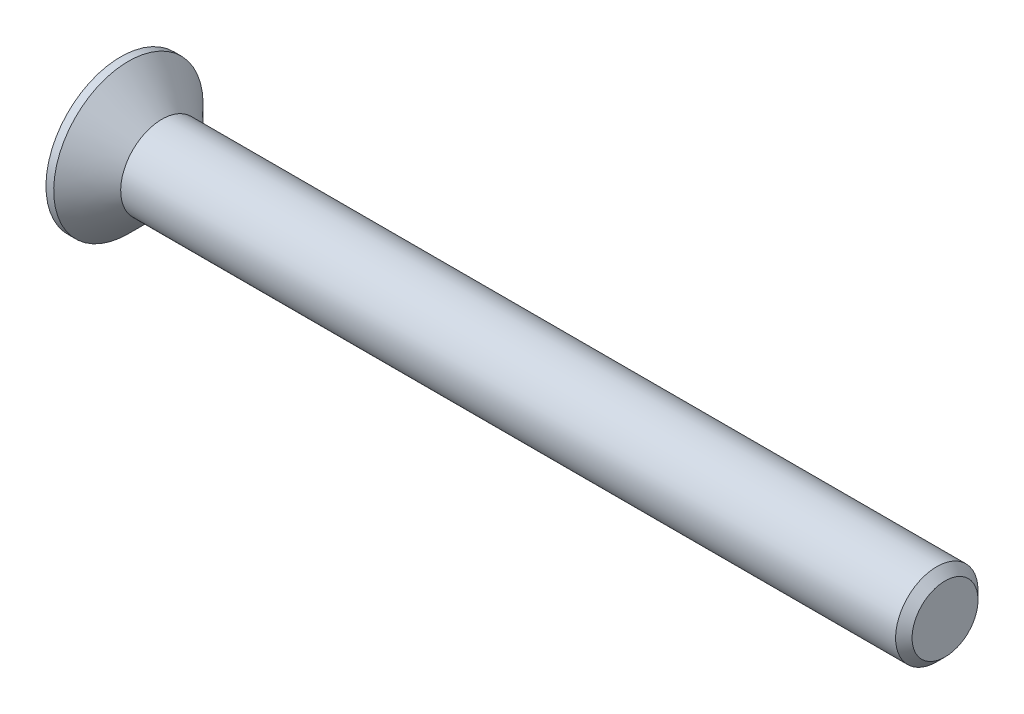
ISO-10303-21;
HEADER;
FILE_DESCRIPTION(('STEP AP214'),'2;1');
FILE_NAME('part.step','',(''),(''),'','','');
FILE_SCHEMA(('AUTOMOTIVE_DESIGN { 1 0 10303 214 1 1 1 1 }'));
ENDSEC;
DATA;
#1=APPLICATION_CONTEXT('core data for automotive mechanical design processes');
#2=APPLICATION_PROTOCOL_DEFINITION('international standard','automotive_design',2000,#1);
#3=PRODUCT_CONTEXT('',#1,'mechanical');
#4=PRODUCT('Part','Part','',(#3));
#5=PRODUCT_RELATED_PRODUCT_CATEGORY('part','',(#4));
#6=PRODUCT_DEFINITION_FORMATION('','',#4);
#7=PRODUCT_DEFINITION_CONTEXT('part definition',#1,'design');
#8=PRODUCT_DEFINITION('design','',#6,#7);
#9=PRODUCT_DEFINITION_SHAPE('','',#8);
#10=(LENGTH_UNIT() NAMED_UNIT(*) SI_UNIT(.MILLI.,.METRE.));
#11=(NAMED_UNIT(*) PLANE_ANGLE_UNIT() SI_UNIT($,.RADIAN.));
#12=(NAMED_UNIT(*) SI_UNIT($,.STERADIAN.) SOLID_ANGLE_UNIT());
#13=UNCERTAINTY_MEASURE_WITH_UNIT(LENGTH_MEASURE(1.E-05),#10,'distance_accuracy_value','');
#14=(GEOMETRIC_REPRESENTATION_CONTEXT(3) GLOBAL_UNCERTAINTY_ASSIGNED_CONTEXT((#13)) GLOBAL_UNIT_ASSIGNED_CONTEXT((#10,
#11,#12)) REPRESENTATION_CONTEXT('',''));
#15=CARTESIAN_POINT('',(0.,0.,0.));
#16=DIRECTION('',(0.,0.,1.));
#17=DIRECTION('',(1.,0.,0.));
#18=AXIS2_PLACEMENT_3D('',#15,#16,#17);
#19=CARTESIAN_POINT('',(0.,0.,0.));
#20=DIRECTION('',(-1.,0.,0.));
#21=DIRECTION('',(0.,-1.,0.));
#22=AXIS2_PLACEMENT_3D('',#19,#20,#21);
#23=CONICAL_SURFACE('',#22,4.,0.78539816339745);
#24=CARTESIAN_POINT('',(-3.24999999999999,0.,0.));
#25=DIRECTION('',(-1.,0.,0.));
#26=DIRECTION('',(0.,-1.,0.));
#27=AXIS2_PLACEMENT_3D('',#24,#25,#26);
#28=CIRCLE('',#27,7.25);
#29=CARTESIAN_POINT('',(-3.24999999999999,-7.25,0.));
#30=VERTEX_POINT('',#29);
#31=EDGE_CURVE('E188',#30,#30,#28,.T.);
#32=ORIENTED_EDGE('',*,*,#31,.F.);
#33=EDGE_LOOP('',(#32));
#34=FACE_BOUND('',#33,.T.);
#35=CARTESIAN_POINT('',(0.,0.,0.));
#36=DIRECTION('',(-1.,0.,0.));
#37=DIRECTION('',(0.,-1.,0.));
#38=AXIS2_PLACEMENT_3D('',#35,#36,#37);
#39=CIRCLE('',#38,4.);
#40=CARTESIAN_POINT('',(0.,-4.,0.));
#41=VERTEX_POINT('',#40);
#42=EDGE_CURVE('E211',#41,#41,#39,.T.);
#43=ORIENTED_EDGE('',*,*,#42,.T.);
#44=EDGE_LOOP('',(#43));
#45=FACE_BOUND('',#44,.T.);
#46=ADVANCED_FACE('F32',(#34,#45),#23,.T.);
#47=CARTESIAN_POINT('',(-4.,0.,0.));
#48=DIRECTION('',(-1.,0.,0.));
#49=DIRECTION('',(0.,-1.,0.));
#50=AXIS2_PLACEMENT_3D('',#47,#48,#49);
#51=CYLINDRICAL_SURFACE('',#50,4.);
#52=CARTESIAN_POINT('',(75.2,0.,0.));
#53=DIRECTION('',(-1.,0.,0.));
#54=DIRECTION('',(0.,-1.,0.));
#55=AXIS2_PLACEMENT_3D('',#52,#53,#54);
#56=CIRCLE('',#55,4.);
#57=CARTESIAN_POINT('',(75.2,-4.,0.));
#58=VERTEX_POINT('',#57);
#59=EDGE_CURVE('E40',#58,#58,#56,.T.);
#60=ORIENTED_EDGE('',*,*,#59,.T.);
#61=EDGE_LOOP('',(#60));
#62=FACE_BOUND('',#61,.T.);
#63=ORIENTED_EDGE('',*,*,#42,.F.);
#64=EDGE_LOOP('',(#63));
#65=FACE_BOUND('',#64,.T.);
#66=ADVANCED_FACE('F216',(#62,#65),#51,.T.);
#67=CARTESIAN_POINT('',(76.,0.,0.));
#68=DIRECTION('',(-1.,0.,0.));
#69=DIRECTION('',(0.,-1.,0.));
#70=AXIS2_PLACEMENT_3D('',#67,#68,#69);
#71=PLANE('',#70);
#72=CARTESIAN_POINT('',(76.,0.,0.));
#73=DIRECTION('',(-1.,0.,0.));
#74=DIRECTION('',(0.,-1.,0.));
#75=AXIS2_PLACEMENT_3D('',#72,#73,#74);
#76=CIRCLE('',#75,3.2);
#77=CARTESIAN_POINT('',(76.,-3.2,0.));
#78=VERTEX_POINT('',#77);
#79=EDGE_CURVE('E11',#78,#78,#76,.F.);
#80=ORIENTED_EDGE('',*,*,#79,.T.);
#81=EDGE_LOOP('',(#80));
#82=FACE_BOUND('',#81,.T.);
#83=ADVANCED_FACE('F238',(#82),#71,.F.);
#84=CARTESIAN_POINT('',(-4.,7.25,0.));
#85=DIRECTION('',(1.,0.,0.));
#86=DIRECTION('',(0.,1.,0.));
#87=AXIS2_PLACEMENT_3D('',#84,#85,#86);
#88=PLANE('',#87);
#89=DIRECTION('',(0.,0.,-1.));
#90=VECTOR('',#89,1.);
#91=CARTESIAN_POINT('',(-4.,1.09,-4.35));
#92=LINE('',#91,#90);
#93=CARTESIAN_POINT('',(-4.,1.09,-1.09));
#94=VERTEX_POINT('',#93);
#95=CARTESIAN_POINT('',(-4.,1.09,-4.35));
#96=VERTEX_POINT('',#95);
#97=EDGE_CURVE('E157',#94,#96,#92,.T.);
#98=ORIENTED_EDGE('',*,*,#97,.F.);
#99=DIRECTION('',(0.,-1.,0.));
#100=VECTOR('',#99,1.);
#101=CARTESIAN_POINT('',(-4.,1.09,-1.09));
#102=LINE('',#101,#100);
#103=CARTESIAN_POINT('',(-4.,4.35,-1.09));
#104=VERTEX_POINT('',#103);
#105=EDGE_CURVE('E47',#104,#94,#102,.T.);
#106=ORIENTED_EDGE('',*,*,#105,.F.);
#107=DIRECTION('',(0.,0.,-1.));
#108=VECTOR('',#107,1.);
#109=CARTESIAN_POINT('',(-4.,4.35,-1.09));
#110=LINE('',#109,#108);
#111=CARTESIAN_POINT('',(-4.,4.35,1.09));
#112=VERTEX_POINT('',#111);
#113=EDGE_CURVE('E184',#112,#104,#110,.T.);
#114=ORIENTED_EDGE('',*,*,#113,.F.);
#115=DIRECTION('',(0.,1.,0.));
#116=VECTOR('',#115,1.);
#117=CARTESIAN_POINT('',(-4.,4.35,1.09));
#118=LINE('',#117,#116);
#119=CARTESIAN_POINT('',(-4.,1.09,1.09));
#120=VERTEX_POINT('',#119);
#121=EDGE_CURVE('E182',#120,#112,#118,.T.);
#122=ORIENTED_EDGE('',*,*,#121,.F.);
#123=DIRECTION('',(0.,0.,-1.));
#124=VECTOR('',#123,1.);
#125=CARTESIAN_POINT('',(-4.,1.09,1.09));
#126=LINE('',#125,#124);
#127=CARTESIAN_POINT('',(-4.,1.09,4.35));
#128=VERTEX_POINT('',#127);
#129=EDGE_CURVE('E131',#128,#120,#126,.T.);
#130=ORIENTED_EDGE('',*,*,#129,.F.);
#131=DIRECTION('',(0.,1.,0.));
#132=VECTOR('',#131,1.);
#133=CARTESIAN_POINT('',(-4.,1.09,4.35));
#134=LINE('',#133,#132);
#135=CARTESIAN_POINT('',(-4.,-1.09,4.35));
#136=VERTEX_POINT('',#135);
#137=EDGE_CURVE('E178',#136,#128,#134,.T.);
#138=ORIENTED_EDGE('',*,*,#137,.F.);
#139=DIRECTION('',(0.,0.,1.));
#140=VECTOR('',#139,1.);
#141=CARTESIAN_POINT('',(-4.,-1.09,4.35));
#142=LINE('',#141,#140);
#143=CARTESIAN_POINT('',(-4.,-1.09,1.09));
#144=VERTEX_POINT('',#143);
#145=EDGE_CURVE('E175',#144,#136,#142,.T.);
#146=ORIENTED_EDGE('',*,*,#145,.F.);
#147=DIRECTION('',(0.,1.,0.));
#148=VECTOR('',#147,1.);
#149=CARTESIAN_POINT('',(-4.,-1.09,1.09));
#150=LINE('',#149,#148);
#151=CARTESIAN_POINT('',(-4.,-4.35,1.09));
#152=VERTEX_POINT('',#151);
#153=EDGE_CURVE('E172',#152,#144,#150,.T.);
#154=ORIENTED_EDGE('',*,*,#153,.F.);
#155=DIRECTION('',(0.,0.,1.));
#156=VECTOR('',#155,1.);
#157=CARTESIAN_POINT('',(-4.,-4.35,1.09));
#158=LINE('',#157,#156);
#159=CARTESIAN_POINT('',(-4.,-4.35,-1.09));
#160=VERTEX_POINT('',#159);
#161=EDGE_CURVE('E169',#160,#152,#158,.T.);
#162=ORIENTED_EDGE('',*,*,#161,.F.);
#163=DIRECTION('',(0.,-1.,0.));
#164=VECTOR('',#163,1.);
#165=CARTESIAN_POINT('',(-4.,-4.35,-1.09));
#166=LINE('',#165,#164);
#167=CARTESIAN_POINT('',(-4.,-1.09,-1.09));
#168=VERTEX_POINT('',#167);
#169=EDGE_CURVE('E166',#168,#160,#166,.T.);
#170=ORIENTED_EDGE('',*,*,#169,.F.);
#171=DIRECTION('',(0.,0.,1.));
#172=VECTOR('',#171,1.);
#173=CARTESIAN_POINT('',(-4.,-1.09,-1.09));
#174=LINE('',#173,#172);
#175=CARTESIAN_POINT('',(-4.,-1.09,-4.35));
#176=VERTEX_POINT('',#175);
#177=EDGE_CURVE('E163',#176,#168,#174,.T.);
#178=ORIENTED_EDGE('',*,*,#177,.F.);
#179=DIRECTION('',(0.,-1.,0.));
#180=VECTOR('',#179,1.);
#181=CARTESIAN_POINT('',(-4.,-1.09,-4.35));
#182=LINE('',#181,#180);
#183=EDGE_CURVE('E160',#96,#176,#182,.T.);
#184=ORIENTED_EDGE('',*,*,#183,.F.);
#185=EDGE_LOOP('',(#98,#106,#114,#122,#130,#138,#146,#154,#162,#170,#178,#184));
#186=FACE_BOUND('',#185,.T.);
#187=CARTESIAN_POINT('',(-4.,0.,0.));
#188=DIRECTION('',(-1.,0.,0.));
#189=DIRECTION('',(0.,-1.,0.));
#190=AXIS2_PLACEMENT_3D('',#187,#188,#189);
#191=CIRCLE('',#190,7.25);
#192=CARTESIAN_POINT('',(-4.,-7.25,0.));
#193=VERTEX_POINT('',#192);
#194=EDGE_CURVE('E208',#193,#193,#191,.T.);
#195=ORIENTED_EDGE('',*,*,#194,.T.);
#196=EDGE_LOOP('',(#195));
#197=FACE_BOUND('',#196,.T.);
#198=ADVANCED_FACE('F229',(#186,#197),#88,.F.);
#199=CARTESIAN_POINT('',(-4.,0.,0.));
#200=DIRECTION('',(-1.,0.,0.));
#201=DIRECTION('',(0.,-1.,0.));
#202=AXIS2_PLACEMENT_3D('',#199,#200,#201);
#203=CYLINDRICAL_SURFACE('',#202,7.25);
#204=ORIENTED_EDGE('',*,*,#194,.F.);
#205=EDGE_LOOP('',(#204));
#206=FACE_BOUND('',#205,.T.);
#207=ORIENTED_EDGE('',*,*,#31,.T.);
#208=EDGE_LOOP('',(#207));
#209=FACE_BOUND('',#208,.T.);
#210=ADVANCED_FACE('F221',(#206,#209),#203,.T.);
#211=CARTESIAN_POINT('',(75.2,0.,0.));
#212=DIRECTION('',(-1.,0.,0.));
#213=DIRECTION('',(0.,-1.,0.));
#214=AXIS2_PLACEMENT_3D('',#211,#212,#213);
#215=CONICAL_SURFACE('',#214,4.,0.785398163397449);
#216=ORIENTED_EDGE('',*,*,#79,.F.);
#217=EDGE_LOOP('',(#216));
#218=FACE_BOUND('',#217,.T.);
#219=ORIENTED_EDGE('',*,*,#59,.F.);
#220=EDGE_LOOP('',(#219));
#221=FACE_BOUND('',#220,.T.);
#222=ADVANCED_FACE('F34',(#218,#221),#215,.T.);
#223=CARTESIAN_POINT('',(-0.55,1.09,-1.09));
#224=DIRECTION('',(0.,0.,-1.));
#225=DIRECTION('',(-1.,0.,0.));
#226=AXIS2_PLACEMENT_3D('',#223,#224,#225);
#227=PLANE('',#226);
#228=ORIENTED_EDGE('',*,*,#105,.T.);
#229=DIRECTION('',(-1.,0.,0.));
#230=VECTOR('',#229,1.);
#231=CARTESIAN_POINT('',(-0.55,1.09,-1.09));
#232=LINE('',#231,#230);
#233=CARTESIAN_POINT('',(-0.55,1.09,-1.09));
#234=VERTEX_POINT('',#233);
#235=EDGE_CURVE('E95',#234,#94,#232,.T.);
#236=ORIENTED_EDGE('',*,*,#235,.F.);
#237=DIRECTION('',(0.,-1.,0.));
#238=VECTOR('',#237,1.);
#239=CARTESIAN_POINT('',(-0.55,1.09,-1.09));
#240=LINE('',#239,#238);
#241=CARTESIAN_POINT('',(-0.55,4.35,-1.09));
#242=VERTEX_POINT('',#241);
#243=EDGE_CURVE('E186',#242,#234,#240,.T.);
#244=ORIENTED_EDGE('',*,*,#243,.F.);
#245=DIRECTION('',(-1.,0.,0.));
#246=VECTOR('',#245,1.);
#247=CARTESIAN_POINT('',(-0.55,4.35,-1.09));
#248=LINE('',#247,#246);
#249=EDGE_CURVE('E55',#242,#104,#248,.T.);
#250=ORIENTED_EDGE('',*,*,#249,.T.);
#251=EDGE_LOOP('',(#228,#236,#244,#250));
#252=FACE_BOUND('',#251,.T.);
#253=ADVANCED_FACE('F220',(#252),#227,.F.);
#254=CARTESIAN_POINT('',(-0.55,4.35,-1.09));
#255=DIRECTION('',(0.,1.,0.));
#256=DIRECTION('',(-1.,0.,0.));
#257=AXIS2_PLACEMENT_3D('',#254,#255,#256);
#258=PLANE('',#257);
#259=ORIENTED_EDGE('',*,*,#113,.T.);
#260=ORIENTED_EDGE('',*,*,#249,.F.);
#261=DIRECTION('',(0.,0.,-1.));
#262=VECTOR('',#261,1.);
#263=CARTESIAN_POINT('',(-0.55,4.35,-1.09));
#264=LINE('',#263,#262);
#265=CARTESIAN_POINT('',(-0.55,4.35,1.09));
#266=VERTEX_POINT('',#265);
#267=EDGE_CURVE('E143',#266,#242,#264,.T.);
#268=ORIENTED_EDGE('',*,*,#267,.F.);
#269=DIRECTION('',(-1.,0.,0.));
#270=VECTOR('',#269,1.);
#271=CARTESIAN_POINT('',(-0.55,4.35,1.09));
#272=LINE('',#271,#270);
#273=EDGE_CURVE('E135',#266,#112,#272,.T.);
#274=ORIENTED_EDGE('',*,*,#273,.T.);
#275=EDGE_LOOP('',(#259,#260,#268,#274));
#276=FACE_BOUND('',#275,.T.);
#277=ADVANCED_FACE('F227',(#276),#258,.F.);
#278=CARTESIAN_POINT('',(-0.55,4.35,1.09));
#279=DIRECTION('',(0.,0.,1.));
#280=DIRECTION('',(1.,0.,0.));
#281=AXIS2_PLACEMENT_3D('',#278,#279,#280);
#282=PLANE('',#281);
#283=ORIENTED_EDGE('',*,*,#121,.T.);
#284=ORIENTED_EDGE('',*,*,#273,.F.);
#285=DIRECTION('',(0.,1.,0.));
#286=VECTOR('',#285,1.);
#287=CARTESIAN_POINT('',(-0.55,4.35,1.09));
#288=LINE('',#287,#286);
#289=CARTESIAN_POINT('',(-0.55,1.09,1.09));
#290=VERTEX_POINT('',#289);
#291=EDGE_CURVE('E139',#290,#266,#288,.T.);
#292=ORIENTED_EDGE('',*,*,#291,.F.);
#293=DIRECTION('',(-1.,0.,0.));
#294=VECTOR('',#293,1.);
#295=CARTESIAN_POINT('',(-0.55,1.09,1.09));
#296=LINE('',#295,#294);
#297=EDGE_CURVE('E124',#290,#120,#296,.T.);
#298=ORIENTED_EDGE('',*,*,#297,.T.);
#299=EDGE_LOOP('',(#283,#284,#292,#298));
#300=FACE_BOUND('',#299,.T.);
#301=ADVANCED_FACE('F140',(#300),#282,.F.);
#302=CARTESIAN_POINT('',(-0.55,1.09,1.09));
#303=DIRECTION('',(0.,1.,0.));
#304=DIRECTION('',(-1.,0.,0.));
#305=AXIS2_PLACEMENT_3D('',#302,#303,#304);
#306=PLANE('',#305);
#307=ORIENTED_EDGE('',*,*,#129,.T.);
#308=ORIENTED_EDGE('',*,*,#297,.F.);
#309=DIRECTION('',(0.,0.,-1.));
#310=VECTOR('',#309,1.);
#311=CARTESIAN_POINT('',(-0.55,1.09,1.09));
#312=LINE('',#311,#310);
#313=CARTESIAN_POINT('',(-0.55,1.09,4.35));
#314=VERTEX_POINT('',#313);
#315=EDGE_CURVE('E128',#314,#290,#312,.T.);
#316=ORIENTED_EDGE('',*,*,#315,.F.);
#317=DIRECTION('',(-1.,0.,0.));
#318=VECTOR('',#317,1.);
#319=CARTESIAN_POINT('',(-0.55,1.09,4.35));
#320=LINE('',#319,#318);
#321=EDGE_CURVE('E136',#314,#128,#320,.T.);
#322=ORIENTED_EDGE('',*,*,#321,.T.);
#323=EDGE_LOOP('',(#307,#308,#316,#322));
#324=FACE_BOUND('',#323,.T.);
#325=ADVANCED_FACE('F126',(#324),#306,.F.);
#326=CARTESIAN_POINT('',(-0.55,1.09,4.35));
#327=DIRECTION('',(0.,0.,1.));
#328=DIRECTION('',(1.,0.,0.));
#329=AXIS2_PLACEMENT_3D('',#326,#327,#328);
#330=PLANE('',#329);
#331=ORIENTED_EDGE('',*,*,#137,.T.);
#332=ORIENTED_EDGE('',*,*,#321,.F.);
#333=DIRECTION('',(0.,1.,0.));
#334=VECTOR('',#333,1.);
#335=CARTESIAN_POINT('',(-0.55,1.09,4.35));
#336=LINE('',#335,#334);
#337=CARTESIAN_POINT('',(-0.55,-1.09,4.35));
#338=VERTEX_POINT('',#337);
#339=EDGE_CURVE('E149',#338,#314,#336,.T.);
#340=ORIENTED_EDGE('',*,*,#339,.F.);
#341=DIRECTION('',(-1.,0.,0.));
#342=VECTOR('',#341,1.);
#343=CARTESIAN_POINT('',(-0.55,-1.09,4.35));
#344=LINE('',#343,#342);
#345=EDGE_CURVE('E191',#338,#136,#344,.T.);
#346=ORIENTED_EDGE('',*,*,#345,.T.);
#347=EDGE_LOOP('',(#331,#332,#340,#346));
#348=FACE_BOUND('',#347,.T.);
#349=ADVANCED_FACE('F276',(#348),#330,.F.);
#350=CARTESIAN_POINT('',(-0.55,-1.09,4.35));
#351=DIRECTION('',(0.,-1.,0.));
#352=DIRECTION('',(1.,0.,0.));
#353=AXIS2_PLACEMENT_3D('',#350,#351,#352);
#354=PLANE('',#353);
#355=ORIENTED_EDGE('',*,*,#145,.T.);
#356=ORIENTED_EDGE('',*,*,#345,.F.);
#357=DIRECTION('',(0.,0.,1.));
#358=VECTOR('',#357,1.);
#359=CARTESIAN_POINT('',(-0.55,-1.09,4.35));
#360=LINE('',#359,#358);
#361=CARTESIAN_POINT('',(-0.55,-1.09,1.09));
#362=VERTEX_POINT('',#361);
#363=EDGE_CURVE('E151',#362,#338,#360,.T.);
#364=ORIENTED_EDGE('',*,*,#363,.F.);
#365=DIRECTION('',(-1.,0.,0.));
#366=VECTOR('',#365,1.);
#367=CARTESIAN_POINT('',(-0.55,-1.09,1.09));
#368=LINE('',#367,#366);
#369=EDGE_CURVE('E193',#362,#144,#368,.T.);
#370=ORIENTED_EDGE('',*,*,#369,.T.);
#371=EDGE_LOOP('',(#355,#356,#364,#370));
#372=FACE_BOUND('',#371,.T.);
#373=ADVANCED_FACE('F272',(#372),#354,.F.);
#374=CARTESIAN_POINT('',(-0.55,-1.09,1.09));
#375=DIRECTION('',(0.,0.,1.));
#376=DIRECTION('',(1.,0.,0.));
#377=AXIS2_PLACEMENT_3D('',#374,#375,#376);
#378=PLANE('',#377);
#379=ORIENTED_EDGE('',*,*,#153,.T.);
#380=ORIENTED_EDGE('',*,*,#369,.F.);
#381=DIRECTION('',(0.,1.,0.));
#382=VECTOR('',#381,1.);
#383=CARTESIAN_POINT('',(-0.55,-1.09,1.09));
#384=LINE('',#383,#382);
#385=CARTESIAN_POINT('',(-0.55,-4.35,1.09));
#386=VERTEX_POINT('',#385);
#387=EDGE_CURVE('E421',#386,#362,#384,.T.);
#388=ORIENTED_EDGE('',*,*,#387,.F.);
#389=DIRECTION('',(-1.,0.,0.));
#390=VECTOR('',#389,1.);
#391=CARTESIAN_POINT('',(-0.55,-4.35,1.09));
#392=LINE('',#391,#390);
#393=EDGE_CURVE('E195',#386,#152,#392,.T.);
#394=ORIENTED_EDGE('',*,*,#393,.T.);
#395=EDGE_LOOP('',(#379,#380,#388,#394));
#396=FACE_BOUND('',#395,.T.);
#397=ADVANCED_FACE('F268',(#396),#378,.F.);
#398=CARTESIAN_POINT('',(-0.55,-4.35,1.09));
#399=DIRECTION('',(0.,-1.,0.));
#400=DIRECTION('',(1.,0.,0.));
#401=AXIS2_PLACEMENT_3D('',#398,#399,#400);
#402=PLANE('',#401);
#403=ORIENTED_EDGE('',*,*,#161,.T.);
#404=ORIENTED_EDGE('',*,*,#393,.F.);
#405=DIRECTION('',(0.,0.,1.));
#406=VECTOR('',#405,1.);
#407=CARTESIAN_POINT('',(-0.55,-4.35,1.09));
#408=LINE('',#407,#406);
#409=CARTESIAN_POINT('',(-0.55,-4.35,-1.09));
#410=VERTEX_POINT('',#409);
#411=EDGE_CURVE('E418',#410,#386,#408,.T.);
#412=ORIENTED_EDGE('',*,*,#411,.F.);
#413=DIRECTION('',(-1.,0.,0.));
#414=VECTOR('',#413,1.);
#415=CARTESIAN_POINT('',(-0.55,-4.35,-1.09));
#416=LINE('',#415,#414);
#417=EDGE_CURVE('E197',#410,#160,#416,.T.);
#418=ORIENTED_EDGE('',*,*,#417,.T.);
#419=EDGE_LOOP('',(#403,#404,#412,#418));
#420=FACE_BOUND('',#419,.T.);
#421=ADVANCED_FACE('F264',(#420),#402,.F.);
#422=CARTESIAN_POINT('',(-0.55,-4.35,-1.09));
#423=DIRECTION('',(0.,0.,-1.));
#424=DIRECTION('',(-1.,0.,0.));
#425=AXIS2_PLACEMENT_3D('',#422,#423,#424);
#426=PLANE('',#425);
#427=ORIENTED_EDGE('',*,*,#169,.T.);
#428=ORIENTED_EDGE('',*,*,#417,.F.);
#429=DIRECTION('',(0.,-1.,0.));
#430=VECTOR('',#429,1.);
#431=CARTESIAN_POINT('',(-0.55,-4.35,-1.09));
#432=LINE('',#431,#430);
#433=CARTESIAN_POINT('',(-0.55,-1.09,-1.09));
#434=VERTEX_POINT('',#433);
#435=EDGE_CURVE('E415',#434,#410,#432,.T.);
#436=ORIENTED_EDGE('',*,*,#435,.F.);
#437=DIRECTION('',(-1.,0.,0.));
#438=VECTOR('',#437,1.);
#439=CARTESIAN_POINT('',(-0.55,-1.09,-1.09));
#440=LINE('',#439,#438);
#441=EDGE_CURVE('E199',#434,#168,#440,.T.);
#442=ORIENTED_EDGE('',*,*,#441,.T.);
#443=EDGE_LOOP('',(#427,#428,#436,#442));
#444=FACE_BOUND('',#443,.T.);
#445=ADVANCED_FACE('F260',(#444),#426,.F.);
#446=CARTESIAN_POINT('',(-0.55,-1.09,-1.09));
#447=DIRECTION('',(0.,-1.,0.));
#448=DIRECTION('',(1.,0.,0.));
#449=AXIS2_PLACEMENT_3D('',#446,#447,#448);
#450=PLANE('',#449);
#451=ORIENTED_EDGE('',*,*,#177,.T.);
#452=ORIENTED_EDGE('',*,*,#441,.F.);
#453=DIRECTION('',(0.,0.,1.));
#454=VECTOR('',#453,1.);
#455=CARTESIAN_POINT('',(-0.55,-1.09,-1.09));
#456=LINE('',#455,#454);
#457=CARTESIAN_POINT('',(-0.55,-1.09,-4.35));
#458=VERTEX_POINT('',#457);
#459=EDGE_CURVE('E412',#458,#434,#456,.T.);
#460=ORIENTED_EDGE('',*,*,#459,.F.);
#461=DIRECTION('',(-1.,0.,0.));
#462=VECTOR('',#461,1.);
#463=CARTESIAN_POINT('',(-0.55,-1.09,-4.35));
#464=LINE('',#463,#462);
#465=EDGE_CURVE('E201',#458,#176,#464,.T.);
#466=ORIENTED_EDGE('',*,*,#465,.T.);
#467=EDGE_LOOP('',(#451,#452,#460,#466));
#468=FACE_BOUND('',#467,.T.);
#469=ADVANCED_FACE('F256',(#468),#450,.F.);
#470=CARTESIAN_POINT('',(-0.55,-1.09,-4.35));
#471=DIRECTION('',(0.,0.,-1.));
#472=DIRECTION('',(-1.,0.,0.));
#473=AXIS2_PLACEMENT_3D('',#470,#471,#472);
#474=PLANE('',#473);
#475=ORIENTED_EDGE('',*,*,#183,.T.);
#476=ORIENTED_EDGE('',*,*,#465,.F.);
#477=DIRECTION('',(0.,-1.,0.));
#478=VECTOR('',#477,1.);
#479=CARTESIAN_POINT('',(-0.55,-1.09,-4.35));
#480=LINE('',#479,#478);
#481=CARTESIAN_POINT('',(-0.55,1.09,-4.35));
#482=VERTEX_POINT('',#481);
#483=EDGE_CURVE('E407',#482,#458,#480,.T.);
#484=ORIENTED_EDGE('',*,*,#483,.F.);
#485=DIRECTION('',(-1.,0.,0.));
#486=VECTOR('',#485,1.);
#487=CARTESIAN_POINT('',(-0.55,1.09,-4.35));
#488=LINE('',#487,#486);
#489=EDGE_CURVE('E203',#482,#96,#488,.T.);
#490=ORIENTED_EDGE('',*,*,#489,.T.);
#491=EDGE_LOOP('',(#475,#476,#484,#490));
#492=FACE_BOUND('',#491,.T.);
#493=ADVANCED_FACE('F252',(#492),#474,.F.);
#494=CARTESIAN_POINT('',(-0.55,1.09,-4.35));
#495=DIRECTION('',(0.,1.,0.));
#496=DIRECTION('',(-1.,0.,0.));
#497=AXIS2_PLACEMENT_3D('',#494,#495,#496);
#498=PLANE('',#497);
#499=ORIENTED_EDGE('',*,*,#97,.T.);
#500=ORIENTED_EDGE('',*,*,#489,.F.);
#501=DIRECTION('',(0.,0.,-1.));
#502=VECTOR('',#501,1.);
#503=CARTESIAN_POINT('',(-0.55,1.09,-4.35));
#504=LINE('',#503,#502);
#505=EDGE_CURVE('E405',#234,#482,#504,.T.);
#506=ORIENTED_EDGE('',*,*,#505,.F.);
#507=ORIENTED_EDGE('',*,*,#235,.T.);
#508=EDGE_LOOP('',(#499,#500,#506,#507));
#509=FACE_BOUND('',#508,.T.);
#510=ADVANCED_FACE('F249',(#509),#498,.F.);
#511=CARTESIAN_POINT('',(-0.55,0.,0.));
#512=DIRECTION('',(1.,0.,0.));
#513=DIRECTION('',(0.,0.,-1.));
#514=AXIS2_PLACEMENT_3D('',#511,#512,#513);
#515=PLANE('',#514);
#516=ORIENTED_EDGE('',*,*,#243,.T.);
#517=ORIENTED_EDGE('',*,*,#505,.T.);
#518=ORIENTED_EDGE('',*,*,#483,.T.);
#519=ORIENTED_EDGE('',*,*,#459,.T.);
#520=ORIENTED_EDGE('',*,*,#435,.T.);
#521=ORIENTED_EDGE('',*,*,#411,.T.);
#522=ORIENTED_EDGE('',*,*,#387,.T.);
#523=ORIENTED_EDGE('',*,*,#363,.T.);
#524=ORIENTED_EDGE('',*,*,#339,.T.);
#525=ORIENTED_EDGE('',*,*,#315,.T.);
#526=ORIENTED_EDGE('',*,*,#291,.T.);
#527=ORIENTED_EDGE('',*,*,#267,.T.);
#528=EDGE_LOOP('',(#516,#517,#518,#519,#520,#521,#522,#523,#524,#525,#526,#527));
#529=FACE_BOUND('',#528,.T.);
#530=ADVANCED_FACE('F146',(#529),#515,.F.);
#531=CLOSED_SHELL('',(#46,#66,#83,#198,#210,#222,#253,#277,#301,#325,#349,#373,#397,#421,#445,
#469,#493,#510,#530));
#532=MANIFOLD_SOLID_BREP('B2',#531);
#533=ADVANCED_BREP_SHAPE_REPRESENTATION('',(#18,#532),#14);
#534=SHAPE_DEFINITION_REPRESENTATION(#9,#533);
ENDSEC;
END-ISO-10303-21;
